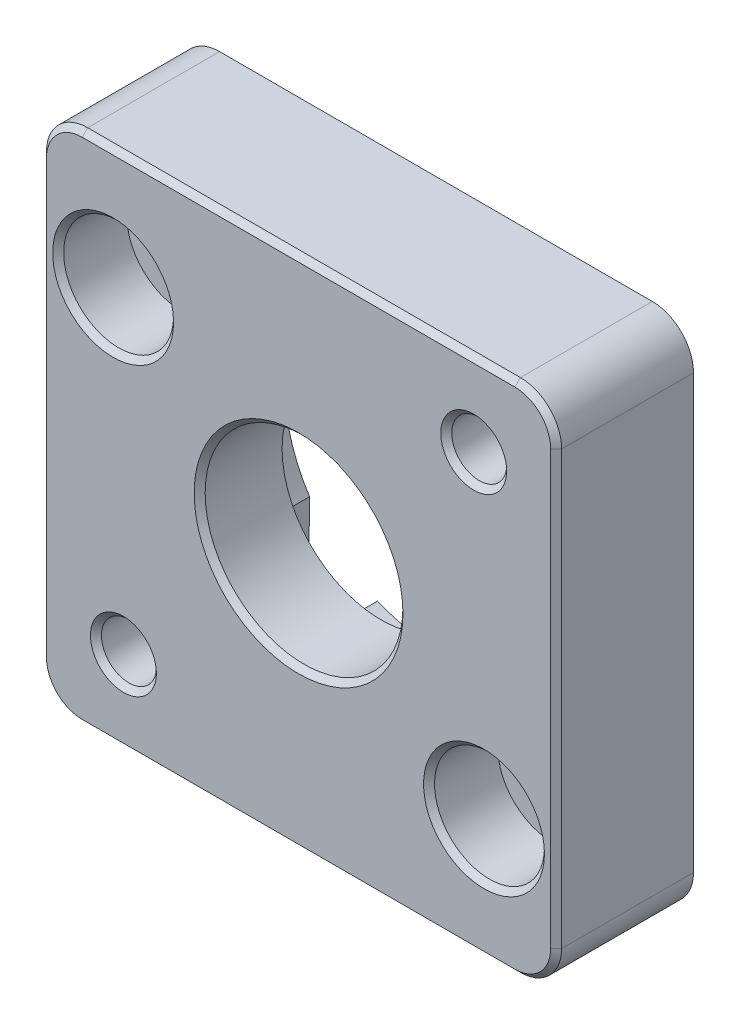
ISO-10303-21;
HEADER;
FILE_DESCRIPTION(('STEP AP214'),'2;1');
FILE_NAME('part.step','',(''),(''),'','','');
FILE_SCHEMA(('AUTOMOTIVE_DESIGN { 1 0 10303 214 1 1 1 1 }'));
ENDSEC;
DATA;
#1=APPLICATION_CONTEXT('core data for automotive mechanical design processes');
#2=APPLICATION_PROTOCOL_DEFINITION('international standard','automotive_design',2000,#1);
#3=PRODUCT_CONTEXT('',#1,'mechanical');
#4=PRODUCT('Part','Part','',(#3));
#5=PRODUCT_RELATED_PRODUCT_CATEGORY('part','',(#4));
#6=PRODUCT_DEFINITION_FORMATION('','',#4);
#7=PRODUCT_DEFINITION_CONTEXT('part definition',#1,'design');
#8=PRODUCT_DEFINITION('design','',#6,#7);
#9=PRODUCT_DEFINITION_SHAPE('','',#8);
#10=(LENGTH_UNIT() NAMED_UNIT(*) SI_UNIT(.MILLI.,.METRE.));
#11=(NAMED_UNIT(*) PLANE_ANGLE_UNIT() SI_UNIT($,.RADIAN.));
#12=(NAMED_UNIT(*) SI_UNIT($,.STERADIAN.) SOLID_ANGLE_UNIT());
#13=UNCERTAINTY_MEASURE_WITH_UNIT(LENGTH_MEASURE(1.E-05),#10,'distance_accuracy_value','');
#14=(GEOMETRIC_REPRESENTATION_CONTEXT(3) GLOBAL_UNCERTAINTY_ASSIGNED_CONTEXT((#13)) GLOBAL_UNIT_ASSIGNED_CONTEXT((#10,
#11,#12)) REPRESENTATION_CONTEXT('',''));
#15=CARTESIAN_POINT('',(0.,0.,0.));
#16=DIRECTION('',(0.,0.,1.));
#17=DIRECTION('',(1.,0.,0.));
#18=AXIS2_PLACEMENT_3D('',#15,#16,#17);
#19=CARTESIAN_POINT('',(-5.25000000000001,8.75000000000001,10.));
#20=DIRECTION('',(0.,0.,-1.));
#21=DIRECTION('',(-1.,0.,0.));
#22=AXIS2_PLACEMENT_3D('',#19,#20,#21);
#23=CYLINDRICAL_SURFACE('',#22,2.25000000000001);
#24=CARTESIAN_POINT('',(-5.25000000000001,8.75000000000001,5.));
#25=DIRECTION('',(0.,0.,-1.));
#26=DIRECTION('',(-1.,0.,0.));
#27=AXIS2_PLACEMENT_3D('',#24,#25,#26);
#28=CIRCLE('',#27,2.25000000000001);
#29=CARTESIAN_POINT('',(-7.50000000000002,8.75000000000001,5.));
#30=VERTEX_POINT('',#29);
#31=EDGE_CURVE('E249',#30,#30,#28,.T.);
#32=ORIENTED_EDGE('',*,*,#31,.F.);
#33=EDGE_LOOP('',(#32));
#34=FACE_BOUND('',#33,.T.);
#35=CARTESIAN_POINT('',(-5.25000000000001,8.75000000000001,0.));
#36=DIRECTION('',(0.,0.,-1.));
#37=DIRECTION('',(-1.,0.,0.));
#38=AXIS2_PLACEMENT_3D('',#35,#36,#37);
#39=CIRCLE('',#38,2.25000000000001);
#40=CARTESIAN_POINT('',(-7.50000000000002,8.75000000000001,0.));
#41=VERTEX_POINT('',#40);
#42=EDGE_CURVE('E243',#41,#41,#39,.T.);
#43=ORIENTED_EDGE('',*,*,#42,.T.);
#44=EDGE_LOOP('',(#43));
#45=FACE_BOUND('',#44,.T.);
#46=ADVANCED_FACE('F17',(#34,#45),#23,.F.);
#47=CARTESIAN_POINT('',(-32.25,28.75,10.));
#48=DIRECTION('',(0.,0.,-1.));
#49=DIRECTION('',(-1.,0.,0.));
#50=AXIS2_PLACEMENT_3D('',#47,#48,#49);
#51=CYLINDRICAL_SURFACE('',#50,2.25000000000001);
#52=CARTESIAN_POINT('',(-32.25,28.75,5.));
#53=DIRECTION('',(0.,0.,-1.));
#54=DIRECTION('',(-1.,0.,0.));
#55=AXIS2_PLACEMENT_3D('',#52,#53,#54);
#56=CIRCLE('',#55,2.25000000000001);
#57=CARTESIAN_POINT('',(-34.5,28.75,5.));
#58=VERTEX_POINT('',#57);
#59=EDGE_CURVE('E246',#58,#58,#56,.T.);
#60=ORIENTED_EDGE('',*,*,#59,.F.);
#61=EDGE_LOOP('',(#60));
#62=FACE_BOUND('',#61,.T.);
#63=CARTESIAN_POINT('',(-32.25,28.75,0.));
#64=DIRECTION('',(0.,0.,-1.));
#65=DIRECTION('',(-1.,0.,0.));
#66=AXIS2_PLACEMENT_3D('',#63,#64,#65);
#67=CIRCLE('',#66,2.25000000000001);
#68=CARTESIAN_POINT('',(-34.5,28.75,0.));
#69=VERTEX_POINT('',#68);
#70=EDGE_CURVE('E240',#69,#69,#67,.T.);
#71=ORIENTED_EDGE('',*,*,#70,.T.);
#72=EDGE_LOOP('',(#71));
#73=FACE_BOUND('',#72,.T.);
#74=ADVANCED_FACE('F804',(#62,#73),#51,.F.);
#75=CARTESIAN_POINT('',(-25.5,8.75,16.8197090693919));
#76=DIRECTION('',(0.,0.,-1.));
#77=DIRECTION('',(-1.,0.,0.));
#78=AXIS2_PLACEMENT_3D('',#75,#76,#77);
#79=CYLINDRICAL_SURFACE('',#78,2.5);
#80=DIRECTION('',(0.,0.,-1.));
#81=VECTOR('',#80,1.);
#82=CARTESIAN_POINT('',(-23.0041547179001,8.60592943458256,7.));
#83=LINE('',#82,#81);
#84=CARTESIAN_POINT('',(-23.0041547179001,8.60592943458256,4.));
#85=VERTEX_POINT('',#84);
#86=CARTESIAN_POINT('',(-23.0041547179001,8.60592943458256,0.));
#87=VERTEX_POINT('',#86);
#88=EDGE_CURVE('E120',#85,#87,#83,.T.);
#89=ORIENTED_EDGE('',*,*,#88,.T.);
#90=CARTESIAN_POINT('',(-25.5,8.75,0.));
#91=DIRECTION('',(0.,0.,-1.));
#92=DIRECTION('',(-1.,0.,0.));
#93=AXIS2_PLACEMENT_3D('',#90,#91,#92);
#94=CIRCLE('',#93,2.5);
#95=CARTESIAN_POINT('',(-27.999780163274,8.7831532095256,0.));
#96=VERTEX_POINT('',#95);
#97=EDGE_CURVE('E238',#87,#96,#94,.T.);
#98=ORIENTED_EDGE('',*,*,#97,.T.);
#99=DIRECTION('',(0.,0.,1.));
#100=VECTOR('',#99,1.);
#101=CARTESIAN_POINT('',(-27.999780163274,8.7831532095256,16.8197090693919));
#102=LINE('',#101,#100);
#103=CARTESIAN_POINT('',(-27.999780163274,8.7831532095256,4.));
#104=VERTEX_POINT('',#103);
#105=EDGE_CURVE('E175',#96,#104,#102,.T.);
#106=ORIENTED_EDGE('',*,*,#105,.T.);
#107=CARTESIAN_POINT('',(-25.5,8.75,4.));
#108=DIRECTION('',(0.,0.,-1.));
#109=DIRECTION('',(-1.,0.,0.));
#110=AXIS2_PLACEMENT_3D('',#107,#108,#109);
#111=CIRCLE('',#110,2.5);
#112=EDGE_CURVE('E252',#104,#85,#111,.F.);
#113=ORIENTED_EDGE('',*,*,#112,.T.);
#114=EDGE_LOOP('',(#89,#98,#106,#113));
#115=FACE_BOUND('',#114,.T.);
#116=ADVANCED_FACE('F263',(#115),#79,.F.);
#117=CARTESIAN_POINT('',(-28.1113217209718,0.372824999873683,16.8197090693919));
#118=DIRECTION('',(-0.999912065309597,0.0132612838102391,0.));
#119=DIRECTION('',(-0.0132612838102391,-0.999912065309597,0.));
#120=AXIS2_PLACEMENT_3D('',#117,#118,#119);
#121=PLANE('',#120);
#122=ORIENTED_EDGE('',*,*,#105,.F.);
#123=DIRECTION('',(0.0132612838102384,0.999912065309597,0.));
#124=VECTOR('',#123,1.);
#125=CARTESIAN_POINT('',(-27.999780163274,8.7831532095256,0.));
#126=LINE('',#125,#124);
#127=CARTESIAN_POINT('',(-27.9476151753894,12.7164376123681,0.));
#128=VERTEX_POINT('',#127);
#129=EDGE_CURVE('E237',#96,#128,#126,.T.);
#130=ORIENTED_EDGE('',*,*,#129,.T.);
#131=DIRECTION('',(0.,0.,-1.));
#132=VECTOR('',#131,1.);
#133=CARTESIAN_POINT('',(-27.9476151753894,12.7164376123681,7.));
#134=LINE('',#133,#132);
#135=CARTESIAN_POINT('',(-27.9476151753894,12.7164376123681,4.));
#136=VERTEX_POINT('',#135);
#137=EDGE_CURVE('E173',#128,#136,#134,.F.);
#138=ORIENTED_EDGE('',*,*,#137,.T.);
#139=DIRECTION('',(-0.0132612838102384,-0.999912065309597,0.));
#140=VECTOR('',#139,1.);
#141=CARTESIAN_POINT('',(-27.9476151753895,12.7164376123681,4.));
#142=LINE('',#141,#140);
#143=EDGE_CURVE('E150',#136,#104,#142,.T.);
#144=ORIENTED_EDGE('',*,*,#143,.T.);
#145=EDGE_LOOP('',(#122,#130,#138,#144));
#146=FACE_BOUND('',#145,.T.);
#147=ADVANCED_FACE('F260',(#146),#121,.F.);
#148=CARTESIAN_POINT('',(-18.75,18.75,7.));
#149=DIRECTION('',(0.,0.,-1.));
#150=DIRECTION('',(-1.,0.,0.));
#151=AXIS2_PLACEMENT_3D('',#148,#149,#150);
#152=CYLINDRICAL_SURFACE('',#151,11.);
#153=ORIENTED_EDGE('',*,*,#137,.F.);
#154=CARTESIAN_POINT('',(-18.75,18.75,0.));
#155=DIRECTION('',(0.,0.,-1.));
#156=DIRECTION('',(-1.,0.,0.));
#157=AXIS2_PLACEMENT_3D('',#154,#155,#156);
#158=CIRCLE('',#157,11.);
#159=CARTESIAN_POINT('',(-14.9813195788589,29.0842657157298,0.));
#160=VERTEX_POINT('',#159);
#161=EDGE_CURVE('E235',#128,#160,#158,.T.);
#162=ORIENTED_EDGE('',*,*,#161,.T.);
#163=DIRECTION('',(0.,0.,-1.));
#164=VECTOR('',#163,1.);
#165=CARTESIAN_POINT('',(-14.9813195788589,29.0842657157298,16.8197090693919));
#166=LINE('',#165,#164);
#167=CARTESIAN_POINT('',(-14.9813195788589,29.0842657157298,4.));
#168=VERTEX_POINT('',#167);
#169=EDGE_CURVE('E171',#160,#168,#166,.F.);
#170=ORIENTED_EDGE('',*,*,#169,.T.);
#171=CARTESIAN_POINT('',(-18.75,18.75,4.));
#172=DIRECTION('',(0.,0.,-1.));
#173=DIRECTION('',(-1.,0.,0.));
#174=AXIS2_PLACEMENT_3D('',#171,#172,#173);
#175=CIRCLE('',#174,11.);
#176=EDGE_CURVE('E147',#168,#136,#175,.F.);
#177=ORIENTED_EDGE('',*,*,#176,.T.);
#178=EDGE_LOOP('',(#153,#162,#170,#177));
#179=FACE_BOUND('',#178,.T.);
#180=ADVANCED_FACE('F781',(#179),#152,.F.);
#181=CARTESIAN_POINT('',(-12.,28.75,16.8197090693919));
#182=DIRECTION('',(0.,0.,-1.));
#183=DIRECTION('',(-1.,0.,0.));
#184=AXIS2_PLACEMENT_3D('',#181,#182,#183);
#185=CYLINDRICAL_SURFACE('',#184,3.);
#186=ORIENTED_EDGE('',*,*,#169,.F.);
#187=CARTESIAN_POINT('',(-12.,28.75,0.));
#188=DIRECTION('',(0.,0.,-1.));
#189=DIRECTION('',(-1.,0.,0.));
#190=AXIS2_PLACEMENT_3D('',#187,#188,#189);
#191=CIRCLE('',#190,3.);
#192=CARTESIAN_POINT('',(-9.00026380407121,28.7102161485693,0.));
#193=VERTEX_POINT('',#192);
#194=EDGE_CURVE('E233',#160,#193,#191,.T.);
#195=ORIENTED_EDGE('',*,*,#194,.T.);
#196=DIRECTION('',(0.,0.,1.));
#197=VECTOR('',#196,1.);
#198=CARTESIAN_POINT('',(-9.00026380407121,28.7102161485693,16.8197090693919));
#199=LINE('',#198,#197);
#200=CARTESIAN_POINT('',(-9.00026380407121,28.7102161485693,4.));
#201=VERTEX_POINT('',#200);
#202=EDGE_CURVE('E168',#193,#201,#199,.T.);
#203=ORIENTED_EDGE('',*,*,#202,.T.);
#204=CARTESIAN_POINT('',(-12.,28.75,4.));
#205=DIRECTION('',(0.,0.,-1.));
#206=DIRECTION('',(-1.,0.,0.));
#207=AXIS2_PLACEMENT_3D('',#204,#205,#206);
#208=CIRCLE('',#207,3.);
#209=EDGE_CURVE('E145',#201,#168,#208,.F.);
#210=ORIENTED_EDGE('',*,*,#209,.T.);
#211=EDGE_LOOP('',(#186,#195,#203,#210));
#212=FACE_BOUND('',#211,.T.);
#213=ADVANCED_FACE('F773',(#212),#185,.F.);
#214=CARTESIAN_POINT('',(-9.37938184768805,0.124393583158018,16.8197090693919));
#215=DIRECTION('',(0.999912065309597,-0.013261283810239,0.));
#216=DIRECTION('',(0.013261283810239,0.999912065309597,0.));
#217=AXIS2_PLACEMENT_3D('',#214,#215,#216);
#218=PLANE('',#217);
#219=ORIENTED_EDGE('',*,*,#202,.F.);
#220=DIRECTION('',(-0.013261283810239,-0.999912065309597,0.));
#221=VECTOR('',#220,1.);
#222=CARTESIAN_POINT('',(-9.00026380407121,28.7102161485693,0.));
#223=LINE('',#222,#221);
#224=CARTESIAN_POINT('',(-9.06323470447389,23.9621567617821,0.));
#225=VERTEX_POINT('',#224);
#226=EDGE_CURVE('E133',#193,#225,#223,.T.);
#227=ORIENTED_EDGE('',*,*,#226,.T.);
#228=DIRECTION('',(0.,0.,-1.));
#229=VECTOR('',#228,1.);
#230=CARTESIAN_POINT('',(-9.06323470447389,23.9621567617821,7.));
#231=LINE('',#230,#229);
#232=CARTESIAN_POINT('',(-9.06323470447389,23.9621567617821,4.));
#233=VERTEX_POINT('',#232);
#234=EDGE_CURVE('E126',#225,#233,#231,.F.);
#235=ORIENTED_EDGE('',*,*,#234,.T.);
#236=DIRECTION('',(0.0132612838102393,0.999912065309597,0.));
#237=VECTOR('',#236,1.);
#238=CARTESIAN_POINT('',(-9.06323470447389,23.9621567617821,4.));
#239=LINE('',#238,#237);
#240=EDGE_CURVE('E130',#233,#201,#239,.T.);
#241=ORIENTED_EDGE('',*,*,#240,.T.);
#242=EDGE_LOOP('',(#219,#227,#235,#241));
#243=FACE_BOUND('',#242,.T.);
#244=ADVANCED_FACE('F128',(#243),#218,.F.);
#245=CARTESIAN_POINT('',(-18.75,18.75,7.));
#246=DIRECTION('',(0.,0.,-1.));
#247=DIRECTION('',(-1.,0.,0.));
#248=AXIS2_PLACEMENT_3D('',#245,#246,#247);
#249=CYLINDRICAL_SURFACE('',#248,11.);
#250=ORIENTED_EDGE('',*,*,#234,.F.);
#251=CARTESIAN_POINT('',(-18.75,18.75,0.));
#252=DIRECTION('',(0.,0.,-1.));
#253=DIRECTION('',(-1.,0.,0.));
#254=AXIS2_PLACEMENT_3D('',#251,#252,#253);
#255=CIRCLE('',#254,11.);
#256=EDGE_CURVE('E159',#225,#87,#255,.T.);
#257=ORIENTED_EDGE('',*,*,#256,.T.);
#258=ORIENTED_EDGE('',*,*,#88,.F.);
#259=CARTESIAN_POINT('',(-18.75,18.75,4.));
#260=DIRECTION('',(0.,0.,-1.));
#261=DIRECTION('',(-1.,0.,0.));
#262=AXIS2_PLACEMENT_3D('',#259,#260,#261);
#263=CIRCLE('',#262,11.);
#264=EDGE_CURVE('E20',#85,#233,#263,.F.);
#265=ORIENTED_EDGE('',*,*,#264,.T.);
#266=EDGE_LOOP('',(#250,#257,#258,#265));
#267=FACE_BOUND('',#266,.T.);
#268=ADVANCED_FACE('F137',(#267),#249,.F.);
#269=CARTESIAN_POINT('',(0.,0.,4.));
#270=DIRECTION('',(0.,0.,1.));
#271=DIRECTION('',(1.,0.,0.));
#272=AXIS2_PLACEMENT_3D('',#269,#270,#271);
#273=PLANE('',#272);
#274=ORIENTED_EDGE('',*,*,#143,.F.);
#275=ORIENTED_EDGE('',*,*,#176,.F.);
#276=ORIENTED_EDGE('',*,*,#209,.F.);
#277=ORIENTED_EDGE('',*,*,#240,.F.);
#278=ORIENTED_EDGE('',*,*,#264,.F.);
#279=ORIENTED_EDGE('',*,*,#112,.F.);
#280=EDGE_LOOP('',(#274,#275,#276,#277,#278,#279));
#281=FACE_BOUND('',#280,.T.);
#282=CARTESIAN_POINT('',(-18.7499999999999,18.75,4.));
#283=DIRECTION('',(0.,0.,1.));
#284=DIRECTION('',(1.,0.,0.));
#285=AXIS2_PLACEMENT_3D('',#282,#283,#284);
#286=CIRCLE('',#285,7.2);
#287=CARTESIAN_POINT('',(-11.5499999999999,18.75,4.));
#288=VERTEX_POINT('',#287);
#289=EDGE_CURVE('E217',#288,#288,#286,.T.);
#290=ORIENTED_EDGE('',*,*,#289,.T.);
#291=EDGE_LOOP('',(#290));
#292=FACE_BOUND('',#291,.T.);
#293=ADVANCED_FACE('F141',(#281,#292),#273,.F.);
#294=CARTESIAN_POINT('',(-5.25000000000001,8.75000000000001,5.));
#295=DIRECTION('',(0.,0.,1.));
#296=DIRECTION('',(1.,0.,0.));
#297=AXIS2_PLACEMENT_3D('',#294,#295,#296);
#298=PLANE('',#297);
#299=ORIENTED_EDGE('',*,*,#31,.T.);
#300=EDGE_LOOP('',(#299));
#301=FACE_BOUND('',#300,.T.);
#302=CARTESIAN_POINT('',(-5.25000000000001,8.75000000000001,5.));
#303=DIRECTION('',(0.,0.,1.));
#304=DIRECTION('',(1.,0.,0.));
#305=AXIS2_PLACEMENT_3D('',#302,#303,#304);
#306=CIRCLE('',#305,4.);
#307=CARTESIAN_POINT('',(-1.25000000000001,8.75000000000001,5.));
#308=VERTEX_POINT('',#307);
#309=EDGE_CURVE('E214',#308,#308,#306,.T.);
#310=ORIENTED_EDGE('',*,*,#309,.T.);
#311=EDGE_LOOP('',(#310));
#312=FACE_BOUND('',#311,.T.);
#313=ADVANCED_FACE('F742',(#301,#312),#298,.T.);
#314=CARTESIAN_POINT('',(-32.25,28.75,5.));
#315=DIRECTION('',(0.,0.,1.));
#316=DIRECTION('',(1.,0.,0.));
#317=AXIS2_PLACEMENT_3D('',#314,#315,#316);
#318=PLANE('',#317);
#319=ORIENTED_EDGE('',*,*,#59,.T.);
#320=EDGE_LOOP('',(#319));
#321=FACE_BOUND('',#320,.T.);
#322=CARTESIAN_POINT('',(-32.25,28.75,5.));
#323=DIRECTION('',(0.,0.,1.));
#324=DIRECTION('',(1.,0.,0.));
#325=AXIS2_PLACEMENT_3D('',#322,#323,#324);
#326=CIRCLE('',#325,4.);
#327=CARTESIAN_POINT('',(-28.25,28.75,5.));
#328=VERTEX_POINT('',#327);
#329=EDGE_CURVE('E211',#328,#328,#326,.T.);
#330=ORIENTED_EDGE('',*,*,#329,.T.);
#331=EDGE_LOOP('',(#330));
#332=FACE_BOUND('',#331,.T.);
#333=ADVANCED_FACE('F734',(#321,#332),#318,.T.);
#334=CARTESIAN_POINT('',(0.,0.,0.));
#335=DIRECTION('',(0.,0.,1.));
#336=DIRECTION('',(1.,0.,0.));
#337=AXIS2_PLACEMENT_3D('',#334,#335,#336);
#338=PLANE('',#337);
#339=CARTESIAN_POINT('',(-34.5,3.,0.));
#340=DIRECTION('',(0.,0.,-1.));
#341=DIRECTION('',(-1.,0.,0.));
#342=AXIS2_PLACEMENT_3D('',#339,#340,#341);
#343=CIRCLE('',#342,3.);
#344=CARTESIAN_POINT('',(-37.5,3.,0.));
#345=VERTEX_POINT('',#344);
#346=CARTESIAN_POINT('',(-34.5,0.,0.));
#347=VERTEX_POINT('',#346);
#348=EDGE_CURVE('E163',#345,#347,#343,.F.);
#349=ORIENTED_EDGE('',*,*,#348,.F.);
#350=DIRECTION('',(0.,1.,0.));
#351=VECTOR('',#350,1.);
#352=CARTESIAN_POINT('',(-37.5,37.5,0.));
#353=LINE('',#352,#351);
#354=CARTESIAN_POINT('',(-37.5,34.5,0.));
#355=VERTEX_POINT('',#354);
#356=EDGE_CURVE('E164',#345,#355,#353,.T.);
#357=ORIENTED_EDGE('',*,*,#356,.T.);
#358=CARTESIAN_POINT('',(-34.5,34.5,0.));
#359=DIRECTION('',(0.,0.,-1.));
#360=DIRECTION('',(-1.,0.,0.));
#361=AXIS2_PLACEMENT_3D('',#358,#359,#360);
#362=CIRCLE('',#361,3.);
#363=CARTESIAN_POINT('',(-34.5,37.5,0.));
#364=VERTEX_POINT('',#363);
#365=EDGE_CURVE('E167',#364,#355,#362,.F.);
#366=ORIENTED_EDGE('',*,*,#365,.F.);
#367=DIRECTION('',(1.,0.,0.));
#368=VECTOR('',#367,1.);
#369=CARTESIAN_POINT('',(-37.5,37.5,0.));
#370=LINE('',#369,#368);
#371=CARTESIAN_POINT('',(-3.,37.5,0.));
#372=VERTEX_POINT('',#371);
#373=EDGE_CURVE('E156',#364,#372,#370,.T.);
#374=ORIENTED_EDGE('',*,*,#373,.T.);
#375=CARTESIAN_POINT('',(-3.,34.5,0.));
#376=DIRECTION('',(0.,0.,-1.));
#377=DIRECTION('',(-1.,0.,0.));
#378=AXIS2_PLACEMENT_3D('',#375,#376,#377);
#379=CIRCLE('',#378,3.);
#380=CARTESIAN_POINT('',(0.,34.5,0.));
#381=VERTEX_POINT('',#380);
#382=EDGE_CURVE('E220',#381,#372,#379,.F.);
#383=ORIENTED_EDGE('',*,*,#382,.F.);
#384=DIRECTION('',(0.,1.,0.));
#385=VECTOR('',#384,1.);
#386=CARTESIAN_POINT('',(0.,37.5,0.));
#387=LINE('',#386,#385);
#388=CARTESIAN_POINT('',(0.,3.,0.));
#389=VERTEX_POINT('',#388);
#390=EDGE_CURVE('E152',#381,#389,#387,.F.);
#391=ORIENTED_EDGE('',*,*,#390,.T.);
#392=CARTESIAN_POINT('',(-3.,3.,0.));
#393=DIRECTION('',(0.,0.,-1.));
#394=DIRECTION('',(-1.,0.,0.));
#395=AXIS2_PLACEMENT_3D('',#392,#393,#394);
#396=CIRCLE('',#395,3.);
#397=CARTESIAN_POINT('',(-3.,0.,0.));
#398=VERTEX_POINT('',#397);
#399=EDGE_CURVE('E155',#398,#389,#396,.F.);
#400=ORIENTED_EDGE('',*,*,#399,.F.);
#401=DIRECTION('',(1.,0.,0.));
#402=VECTOR('',#401,1.);
#403=CARTESIAN_POINT('',(-37.5,0.,0.));
#404=LINE('',#403,#402);
#405=EDGE_CURVE('E160',#398,#347,#404,.F.);
#406=ORIENTED_EDGE('',*,*,#405,.T.);
#407=EDGE_LOOP('',(#349,#357,#366,#374,#383,#391,#400,#406));
#408=FACE_BOUND('',#407,.T.);
#409=ORIENTED_EDGE('',*,*,#226,.F.);
#410=ORIENTED_EDGE('',*,*,#194,.F.);
#411=ORIENTED_EDGE('',*,*,#161,.F.);
#412=ORIENTED_EDGE('',*,*,#129,.F.);
#413=ORIENTED_EDGE('',*,*,#97,.F.);
#414=ORIENTED_EDGE('',*,*,#256,.F.);
#415=EDGE_LOOP('',(#409,#410,#411,#412,#413,#414));
#416=FACE_BOUND('',#415,.T.);
#417=ORIENTED_EDGE('',*,*,#70,.F.);
#418=EDGE_LOOP('',(#417));
#419=FACE_BOUND('',#418,.T.);
#420=ORIENTED_EDGE('',*,*,#42,.F.);
#421=EDGE_LOOP('',(#420));
#422=FACE_BOUND('',#421,.T.);
#423=CARTESIAN_POINT('',(-6.,31.5,0.));
#424=DIRECTION('',(0.,0.,1.));
#425=DIRECTION('',(1.,0.,0.));
#426=AXIS2_PLACEMENT_3D('',#423,#424,#425);
#427=CIRCLE('',#426,2.);
#428=CARTESIAN_POINT('',(-4.,31.5,0.));
#429=VERTEX_POINT('',#428);
#430=EDGE_CURVE('E208',#429,#429,#427,.T.);
#431=ORIENTED_EDGE('',*,*,#430,.T.);
#432=EDGE_LOOP('',(#431));
#433=FACE_BOUND('',#432,.T.);
#434=CARTESIAN_POINT('',(-31.5,6.,0.));
#435=DIRECTION('',(0.,0.,1.));
#436=DIRECTION('',(1.,0.,0.));
#437=AXIS2_PLACEMENT_3D('',#434,#435,#436);
#438=CIRCLE('',#437,2.);
#439=CARTESIAN_POINT('',(-29.5,6.,0.));
#440=VERTEX_POINT('',#439);
#441=EDGE_CURVE('E204',#440,#440,#438,.T.);
#442=ORIENTED_EDGE('',*,*,#441,.T.);
#443=EDGE_LOOP('',(#442));
#444=FACE_BOUND('',#443,.T.);
#445=ADVANCED_FACE('F266',(#408,#416,#419,#422,#433,#444),#338,.F.);
#446=CARTESIAN_POINT('',(-37.5,37.5,10.));
#447=DIRECTION('',(0.,-1.,0.));
#448=DIRECTION('',(0.,0.,-1.));
#449=AXIS2_PLACEMENT_3D('',#446,#447,#448);
#450=PLANE('',#449);
#451=DIRECTION('',(1.,0.,0.));
#452=VECTOR('',#451,1.);
#453=CARTESIAN_POINT('',(0.,37.5,9.6));
#454=LINE('',#453,#452);
#455=CARTESIAN_POINT('',(-3.,37.4999999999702,9.60000000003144));
#456=VERTEX_POINT('',#455);
#457=CARTESIAN_POINT('',(-34.5,37.5000000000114,9.59999999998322));
#458=VERTEX_POINT('',#457);
#459=EDGE_CURVE('E207',#456,#458,#454,.F.);
#460=ORIENTED_EDGE('',*,*,#459,.F.);
#461=DIRECTION('',(0.,0.,-1.));
#462=VECTOR('',#461,1.);
#463=CARTESIAN_POINT('',(-3.,37.5,10.));
#464=LINE('',#463,#462);
#465=EDGE_CURVE('E327',#372,#456,#464,.F.);
#466=ORIENTED_EDGE('',*,*,#465,.F.);
#467=ORIENTED_EDGE('',*,*,#373,.F.);
#468=DIRECTION('',(0.,0.,-1.));
#469=VECTOR('',#468,1.);
#470=CARTESIAN_POINT('',(-34.5,37.5,10.));
#471=LINE('',#470,#469);
#472=EDGE_CURVE('E158',#458,#364,#471,.T.);
#473=ORIENTED_EDGE('',*,*,#472,.F.);
#474=EDGE_LOOP('',(#460,#466,#467,#473));
#475=FACE_BOUND('',#474,.T.);
#476=ADVANCED_FACE('F456',(#475),#450,.F.);
#477=CARTESIAN_POINT('',(-34.5,34.5,10.));
#478=DIRECTION('',(0.,0.,-1.));
#479=DIRECTION('',(-1.,0.,0.));
#480=AXIS2_PLACEMENT_3D('',#477,#478,#479);
#481=CYLINDRICAL_SURFACE('',#480,3.);
#482=ORIENTED_EDGE('',*,*,#472,.T.);
#483=ORIENTED_EDGE('',*,*,#365,.T.);
#484=DIRECTION('',(0.,0.,-1.));
#485=VECTOR('',#484,1.);
#486=CARTESIAN_POINT('',(-37.5,34.5,10.));
#487=LINE('',#486,#485);
#488=CARTESIAN_POINT('',(-37.5000000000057,34.5,9.5999999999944));
#489=VERTEX_POINT('',#488);
#490=EDGE_CURVE('E166',#355,#489,#487,.F.);
#491=ORIENTED_EDGE('',*,*,#490,.T.);
#492=CARTESIAN_POINT('',(-34.5,34.5,9.59999999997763));
#493=DIRECTION('',(0.,0.,-1.));
#494=DIRECTION('',(-1.,0.,0.));
#495=AXIS2_PLACEMENT_3D('',#492,#493,#494);
#496=CIRCLE('',#495,3.00000000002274);
#497=EDGE_CURVE('E278',#458,#489,#496,.F.);
#498=ORIENTED_EDGE('',*,*,#497,.F.);
#499=EDGE_LOOP('',(#482,#483,#491,#498));
#500=FACE_BOUND('',#499,.T.);
#501=ADVANCED_FACE('F458',(#500),#481,.T.);
#502=CARTESIAN_POINT('',(-37.5,37.5,10.));
#503=DIRECTION('',(1.,0.,0.));
#504=DIRECTION('',(0.,0.,-1.));
#505=AXIS2_PLACEMENT_3D('',#502,#503,#504);
#506=PLANE('',#505);
#507=DIRECTION('',(0.,1.,0.));
#508=VECTOR('',#507,1.);
#509=CARTESIAN_POINT('',(-37.5,0.,9.6));
#510=LINE('',#509,#508);
#511=CARTESIAN_POINT('',(-37.5000000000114,3.,9.59999999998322));
#512=VERTEX_POINT('',#511);
#513=EDGE_CURVE('E289',#489,#512,#510,.F.);
#514=ORIENTED_EDGE('',*,*,#513,.F.);
#515=ORIENTED_EDGE('',*,*,#490,.F.);
#516=ORIENTED_EDGE('',*,*,#356,.F.);
#517=DIRECTION('',(0.,0.,-1.));
#518=VECTOR('',#517,1.);
#519=CARTESIAN_POINT('',(-37.5,3.,10.));
#520=LINE('',#519,#518);
#521=EDGE_CURVE('E229',#512,#345,#520,.T.);
#522=ORIENTED_EDGE('',*,*,#521,.F.);
#523=EDGE_LOOP('',(#514,#515,#516,#522));
#524=FACE_BOUND('',#523,.T.);
#525=ADVANCED_FACE('F482',(#524),#506,.F.);
#526=CARTESIAN_POINT('',(-34.5,3.,10.));
#527=DIRECTION('',(0.,0.,-1.));
#528=DIRECTION('',(-1.,0.,0.));
#529=AXIS2_PLACEMENT_3D('',#526,#527,#528);
#530=CYLINDRICAL_SURFACE('',#529,3.);
#531=ORIENTED_EDGE('',*,*,#521,.T.);
#532=ORIENTED_EDGE('',*,*,#348,.T.);
#533=DIRECTION('',(0.,0.,1.));
#534=VECTOR('',#533,1.);
#535=CARTESIAN_POINT('',(-34.5,0.,10.));
#536=LINE('',#535,#534);
#537=CARTESIAN_POINT('',(-34.5,-5.6853664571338E-12,9.5999999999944));
#538=VERTEX_POINT('',#537);
#539=EDGE_CURVE('E162',#347,#538,#536,.T.);
#540=ORIENTED_EDGE('',*,*,#539,.T.);
#541=CARTESIAN_POINT('',(-34.5,3.,9.59999999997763));
#542=DIRECTION('',(0.,0.,-1.));
#543=DIRECTION('',(-1.,0.,0.));
#544=AXIS2_PLACEMENT_3D('',#541,#542,#543);
#545=CIRCLE('',#544,3.00000000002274);
#546=EDGE_CURVE('E299',#512,#538,#545,.F.);
#547=ORIENTED_EDGE('',*,*,#546,.F.);
#548=EDGE_LOOP('',(#531,#532,#540,#547));
#549=FACE_BOUND('',#548,.T.);
#550=ADVANCED_FACE('F484',(#549),#530,.T.);
#551=CARTESIAN_POINT('',(-37.5,0.,10.));
#552=DIRECTION('',(0.,1.,0.));
#553=DIRECTION('',(0.,0.,1.));
#554=AXIS2_PLACEMENT_3D('',#551,#552,#553);
#555=PLANE('',#554);
#556=DIRECTION('',(1.,0.,0.));
#557=VECTOR('',#556,1.);
#558=CARTESIAN_POINT('',(0.,0.,9.6));
#559=LINE('',#558,#557);
#560=CARTESIAN_POINT('',(-3.,2.12607573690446E-11,9.60000000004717));
#561=VERTEX_POINT('',#560);
#562=EDGE_CURVE('E309',#538,#561,#559,.T.);
#563=ORIENTED_EDGE('',*,*,#562,.F.);
#564=ORIENTED_EDGE('',*,*,#539,.F.);
#565=ORIENTED_EDGE('',*,*,#405,.F.);
#566=DIRECTION('',(0.,0.,-1.));
#567=VECTOR('',#566,1.);
#568=CARTESIAN_POINT('',(-3.,0.,10.));
#569=LINE('',#568,#567);
#570=EDGE_CURVE('E226',#561,#398,#569,.T.);
#571=ORIENTED_EDGE('',*,*,#570,.F.);
#572=EDGE_LOOP('',(#563,#564,#565,#571));
#573=FACE_BOUND('',#572,.T.);
#574=ADVANCED_FACE('F476',(#573),#555,.F.);
#575=CARTESIAN_POINT('',(-3.,3.,10.));
#576=DIRECTION('',(0.,0.,-1.));
#577=DIRECTION('',(-1.,0.,0.));
#578=AXIS2_PLACEMENT_3D('',#575,#576,#577);
#579=CYLINDRICAL_SURFACE('',#578,3.);
#580=ORIENTED_EDGE('',*,*,#570,.T.);
#581=ORIENTED_EDGE('',*,*,#399,.T.);
#582=DIRECTION('',(0.,0.,1.));
#583=VECTOR('',#582,1.);
#584=CARTESIAN_POINT('',(0.,3.,10.));
#585=LINE('',#584,#583);
#586=CARTESIAN_POINT('',(-7.04858805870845E-12,3.,9.60000000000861));
#587=VERTEX_POINT('',#586);
#588=EDGE_CURVE('E154',#389,#587,#585,.T.);
#589=ORIENTED_EDGE('',*,*,#588,.T.);
#590=CARTESIAN_POINT('',(-3.,3.,9.60000000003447));
#591=DIRECTION('',(0.,0.,-1.));
#592=DIRECTION('',(-1.,0.,0.));
#593=AXIS2_PLACEMENT_3D('',#590,#591,#592);
#594=CIRCLE('',#593,2.99999999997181);
#595=EDGE_CURVE('E319',#561,#587,#594,.F.);
#596=ORIENTED_EDGE('',*,*,#595,.F.);
#597=EDGE_LOOP('',(#580,#581,#589,#596));
#598=FACE_BOUND('',#597,.T.);
#599=ADVANCED_FACE('F478',(#598),#579,.T.);
#600=CARTESIAN_POINT('',(0.,37.5,10.));
#601=DIRECTION('',(-1.,0.,0.));
#602=DIRECTION('',(0.,0.,1.));
#603=AXIS2_PLACEMENT_3D('',#600,#601,#602);
#604=PLANE('',#603);
#605=DIRECTION('',(0.,1.,0.));
#606=VECTOR('',#605,1.);
#607=CARTESIAN_POINT('',(0.,0.,9.6));
#608=LINE('',#607,#606);
#609=CARTESIAN_POINT('',(-2.12614078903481E-11,34.5,9.60000000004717));
#610=VERTEX_POINT('',#609);
#611=EDGE_CURVE('E330',#587,#610,#608,.T.);
#612=ORIENTED_EDGE('',*,*,#611,.F.);
#613=ORIENTED_EDGE('',*,*,#588,.F.);
#614=ORIENTED_EDGE('',*,*,#390,.F.);
#615=DIRECTION('',(0.,0.,-1.));
#616=VECTOR('',#615,1.);
#617=CARTESIAN_POINT('',(0.,34.5,10.));
#618=LINE('',#617,#616);
#619=EDGE_CURVE('E223',#610,#381,#618,.T.);
#620=ORIENTED_EDGE('',*,*,#619,.F.);
#621=EDGE_LOOP('',(#612,#613,#614,#620));
#622=FACE_BOUND('',#621,.T.);
#623=ADVANCED_FACE('F430',(#622),#604,.F.);
#624=CARTESIAN_POINT('',(-3.,34.5,10.));
#625=DIRECTION('',(0.,0.,-1.));
#626=DIRECTION('',(-1.,0.,0.));
#627=AXIS2_PLACEMENT_3D('',#624,#625,#626);
#628=CYLINDRICAL_SURFACE('',#627,3.);
#629=ORIENTED_EDGE('',*,*,#619,.T.);
#630=ORIENTED_EDGE('',*,*,#382,.T.);
#631=ORIENTED_EDGE('',*,*,#465,.T.);
#632=CARTESIAN_POINT('',(-3.,34.5,9.60000000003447));
#633=DIRECTION('',(0.,0.,-1.));
#634=DIRECTION('',(-1.,0.,0.));
#635=AXIS2_PLACEMENT_3D('',#632,#633,#634);
#636=CIRCLE('',#635,2.9999999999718);
#637=EDGE_CURVE('E342',#610,#456,#636,.F.);
#638=ORIENTED_EDGE('',*,*,#637,.F.);
#639=EDGE_LOOP('',(#629,#630,#631,#638));
#640=FACE_BOUND('',#639,.T.);
#641=ADVANCED_FACE('F434',(#640),#628,.T.);
#642=CARTESIAN_POINT('',(-18.7499999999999,18.75,0.));
#643=DIRECTION('',(0.,0.,1.));
#644=DIRECTION('',(1.,0.,0.));
#645=AXIS2_PLACEMENT_3D('',#642,#643,#644);
#646=CYLINDRICAL_SURFACE('',#645,7.2);
#647=ORIENTED_EDGE('',*,*,#289,.F.);
#648=EDGE_LOOP('',(#647));
#649=FACE_BOUND('',#648,.T.);
#650=CARTESIAN_POINT('',(-18.7499999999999,18.75,9.60000000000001));
#651=DIRECTION('',(0.,0.,1.));
#652=DIRECTION('',(1.,0.,0.));
#653=AXIS2_PLACEMENT_3D('',#650,#651,#652);
#654=CIRCLE('',#653,7.2);
#655=CARTESIAN_POINT('',(-11.5499999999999,18.75,9.60000000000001));
#656=VERTEX_POINT('',#655);
#657=EDGE_CURVE('E381',#656,#656,#654,.T.);
#658=ORIENTED_EDGE('',*,*,#657,.T.);
#659=EDGE_LOOP('',(#658));
#660=FACE_BOUND('',#659,.T.);
#661=ADVANCED_FACE('F552',(#649,#660),#646,.F.);
#662=CARTESIAN_POINT('',(-5.25000000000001,8.75000000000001,5.));
#663=DIRECTION('',(0.,0.,1.));
#664=DIRECTION('',(1.,0.,0.));
#665=AXIS2_PLACEMENT_3D('',#662,#663,#664);
#666=CYLINDRICAL_SURFACE('',#665,4.);
#667=ORIENTED_EDGE('',*,*,#309,.F.);
#668=EDGE_LOOP('',(#667));
#669=FACE_BOUND('',#668,.T.);
#670=CARTESIAN_POINT('',(-5.25000000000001,8.75000000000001,9.60000000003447));
#671=DIRECTION('',(0.,0.,1.));
#672=DIRECTION('',(1.,0.,0.));
#673=AXIS2_PLACEMENT_3D('',#670,#671,#672);
#674=CIRCLE('',#673,3.99999999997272);
#675=CARTESIAN_POINT('',(-1.25000000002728,8.75000000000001,9.60000000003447));
#676=VERTEX_POINT('',#675);
#677=EDGE_CURVE('E386',#676,#676,#674,.T.);
#678=ORIENTED_EDGE('',*,*,#677,.T.);
#679=EDGE_LOOP('',(#678));
#680=FACE_BOUND('',#679,.T.);
#681=ADVANCED_FACE('F548',(#669,#680),#666,.F.);
#682=CARTESIAN_POINT('',(-32.25,28.75,5.));
#683=DIRECTION('',(0.,0.,1.));
#684=DIRECTION('',(1.,0.,0.));
#685=AXIS2_PLACEMENT_3D('',#682,#683,#684);
#686=CYLINDRICAL_SURFACE('',#685,4.);
#687=ORIENTED_EDGE('',*,*,#329,.F.);
#688=EDGE_LOOP('',(#687));
#689=FACE_BOUND('',#688,.T.);
#690=CARTESIAN_POINT('',(-32.25,28.75,9.60000000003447));
#691=DIRECTION('',(0.,0.,1.));
#692=DIRECTION('',(1.,0.,0.));
#693=AXIS2_PLACEMENT_3D('',#690,#691,#692);
#694=CIRCLE('',#693,3.9999999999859);
#695=CARTESIAN_POINT('',(-28.2500000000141,28.75,9.60000000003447));
#696=VERTEX_POINT('',#695);
#697=EDGE_CURVE('E391',#696,#696,#694,.T.);
#698=ORIENTED_EDGE('',*,*,#697,.T.);
#699=EDGE_LOOP('',(#698));
#700=FACE_BOUND('',#699,.T.);
#701=ADVANCED_FACE('F544',(#689,#700),#686,.F.);
#702=CARTESIAN_POINT('',(-6.,31.5,0.));
#703=DIRECTION('',(0.,0.,1.));
#704=DIRECTION('',(1.,0.,0.));
#705=AXIS2_PLACEMENT_3D('',#702,#703,#704);
#706=CYLINDRICAL_SURFACE('',#705,2.);
#707=ORIENTED_EDGE('',*,*,#430,.F.);
#708=EDGE_LOOP('',(#707));
#709=FACE_BOUND('',#708,.T.);
#710=CARTESIAN_POINT('',(-6.,31.5,9.59999999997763));
#711=DIRECTION('',(0.,0.,1.));
#712=DIRECTION('',(1.,0.,0.));
#713=AXIS2_PLACEMENT_3D('',#710,#711,#712);
#714=CIRCLE('',#713,1.9999999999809);
#715=CARTESIAN_POINT('',(-4.0000000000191,31.5,9.59999999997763));
#716=VERTEX_POINT('',#715);
#717=EDGE_CURVE('E396',#716,#716,#714,.T.);
#718=ORIENTED_EDGE('',*,*,#717,.T.);
#719=EDGE_LOOP('',(#718));
#720=FACE_BOUND('',#719,.T.);
#721=ADVANCED_FACE('F540',(#709,#720),#706,.F.);
#722=CARTESIAN_POINT('',(-31.5,6.,0.));
#723=DIRECTION('',(0.,0.,1.));
#724=DIRECTION('',(1.,0.,0.));
#725=AXIS2_PLACEMENT_3D('',#722,#723,#724);
#726=CYLINDRICAL_SURFACE('',#725,2.);
#727=ORIENTED_EDGE('',*,*,#441,.F.);
#728=EDGE_LOOP('',(#727));
#729=FACE_BOUND('',#728,.T.);
#730=CARTESIAN_POINT('',(-31.5,6.,9.59999999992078));
#731=DIRECTION('',(0.,0.,1.));
#732=DIRECTION('',(1.,0.,0.));
#733=AXIS2_PLACEMENT_3D('',#730,#731,#732);
#734=CIRCLE('',#733,2.00000000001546);
#735=CARTESIAN_POINT('',(-29.4999999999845,6.,9.59999999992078));
#736=VERTEX_POINT('',#735);
#737=EDGE_CURVE('E401',#736,#736,#734,.T.);
#738=ORIENTED_EDGE('',*,*,#737,.T.);
#739=EDGE_LOOP('',(#738));
#740=FACE_BOUND('',#739,.T.);
#741=ADVANCED_FACE('F537',(#729,#740),#726,.F.);
#742=CARTESIAN_POINT('',(0.,37.1,10.));
#743=DIRECTION('',(0.,0.707106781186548,0.707106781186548));
#744=DIRECTION('',(0.,-0.707106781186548,0.707106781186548));
#745=AXIS2_PLACEMENT_3D('',#742,#743,#744);
#746=PLANE('',#745);
#747=DIRECTION('',(0.,-0.707106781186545,0.70710678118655));
#748=VECTOR('',#747,1.);
#749=CARTESIAN_POINT('',(-34.5000000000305,499000.,-498952.900000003));
#750=LINE('',#749,#748);
#751=CARTESIAN_POINT('',(-34.5,37.0999999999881,10.0000000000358));
#752=VERTEX_POINT('',#751);
#753=EDGE_CURVE('E282',#752,#458,#750,.F.);
#754=ORIENTED_EDGE('',*,*,#753,.F.);
#755=DIRECTION('',(1.,0.,0.));
#756=VECTOR('',#755,1.);
#757=CARTESIAN_POINT('',(0.,37.1,10.));
#758=LINE('',#757,#756);
#759=CARTESIAN_POINT('',(-3.,37.0999999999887,10.0000000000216));
#760=VERTEX_POINT('',#759);
#761=EDGE_CURVE('E203',#760,#752,#758,.F.);
#762=ORIENTED_EDGE('',*,*,#761,.F.);
#763=DIRECTION('',(0.,-0.707106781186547,0.707106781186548));
#764=VECTOR('',#763,1.);
#765=CARTESIAN_POINT('',(-3.00000000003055,499031.5,-498984.4));
#766=LINE('',#765,#764);
#767=EDGE_CURVE('E345',#456,#760,#766,.T.);
#768=ORIENTED_EDGE('',*,*,#767,.F.);
#769=ORIENTED_EDGE('',*,*,#459,.T.);
#770=EDGE_LOOP('',(#754,#762,#768,#769));
#771=FACE_BOUND('',#770,.T.);
#772=ADVANCED_FACE('F440',(#771),#746,.T.);
#773=CARTESIAN_POINT('',(-34.5,34.5,9.59999999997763));
#774=DIRECTION('',(0.,0.,-1.));
#775=DIRECTION('',(-1.,0.,0.));
#776=AXIS2_PLACEMENT_3D('',#773,#774,#775);
#777=CONICAL_SURFACE('',#776,3.00000000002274,0.785398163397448);
#778=DIRECTION('',(0.707106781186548,0.,0.707106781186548));
#779=VECTOR('',#778,1.);
#780=CARTESIAN_POINT('',(-37.1,34.5,10.));
#781=LINE('',#780,#779);
#782=CARTESIAN_POINT('',(-37.0999999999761,34.5,10.0000000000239));
#783=VERTEX_POINT('',#782);
#784=EDGE_CURVE('E281',#783,#489,#781,.F.);
#785=ORIENTED_EDGE('',*,*,#784,.F.);
#786=CARTESIAN_POINT('',(-34.5,34.5,10.0000000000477));
#787=DIRECTION('',(0.,0.,-1.));
#788=DIRECTION('',(-1.,0.,0.));
#789=AXIS2_PLACEMENT_3D('',#786,#787,#788);
#790=CIRCLE('',#789,2.59999999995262);
#791=EDGE_CURVE('E200',#752,#783,#790,.F.);
#792=ORIENTED_EDGE('',*,*,#791,.F.);
#793=ORIENTED_EDGE('',*,*,#753,.T.);
#794=ORIENTED_EDGE('',*,*,#497,.T.);
#795=EDGE_LOOP('',(#785,#792,#793,#794));
#796=FACE_BOUND('',#795,.T.);
#797=ADVANCED_FACE('F462',(#796),#777,.T.);
#798=CARTESIAN_POINT('',(-37.1,0.,10.));
#799=DIRECTION('',(-0.707106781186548,0.,0.707106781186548));
#800=DIRECTION('',(0.707106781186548,0.,0.707106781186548));
#801=AXIS2_PLACEMENT_3D('',#798,#799,#800);
#802=PLANE('',#801);
#803=ORIENTED_EDGE('',*,*,#784,.T.);
#804=ORIENTED_EDGE('',*,*,#513,.T.);
#805=DIRECTION('',(0.707106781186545,0.,0.70710678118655));
#806=VECTOR('',#805,1.);
#807=CARTESIAN_POINT('',(-499000.,3.,-498952.900000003));
#808=LINE('',#807,#806);
#809=CARTESIAN_POINT('',(-37.0999999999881,3.,10.0000000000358));
#810=VERTEX_POINT('',#809);
#811=EDGE_CURVE('E292',#810,#512,#808,.F.);
#812=ORIENTED_EDGE('',*,*,#811,.F.);
#813=DIRECTION('',(0.,1.,0.));
#814=VECTOR('',#813,1.);
#815=CARTESIAN_POINT('',(-37.1,0.,10.));
#816=LINE('',#815,#814);
#817=EDGE_CURVE('E199',#783,#810,#816,.F.);
#818=ORIENTED_EDGE('',*,*,#817,.F.);
#819=EDGE_LOOP('',(#803,#804,#812,#818));
#820=FACE_BOUND('',#819,.T.);
#821=ADVANCED_FACE('F466',(#820),#802,.T.);
#822=CARTESIAN_POINT('',(-34.5,3.,9.59999999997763));
#823=DIRECTION('',(0.,0.,-1.));
#824=DIRECTION('',(-1.,0.,0.));
#825=AXIS2_PLACEMENT_3D('',#822,#823,#824);
#826=CONICAL_SURFACE('',#825,3.00000000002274,0.785398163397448);
#827=ORIENTED_EDGE('',*,*,#811,.T.);
#828=ORIENTED_EDGE('',*,*,#546,.T.);
#829=DIRECTION('',(0.,-0.707106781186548,-0.707106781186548));
#830=VECTOR('',#829,1.);
#831=CARTESIAN_POINT('',(-34.5,0.400000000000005,10.));
#832=LINE('',#831,#830);
#833=CARTESIAN_POINT('',(-34.5,0.400000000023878,10.0000000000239));
#834=VERTEX_POINT('',#833);
#835=EDGE_CURVE('E302',#834,#538,#832,.T.);
#836=ORIENTED_EDGE('',*,*,#835,.F.);
#837=CARTESIAN_POINT('',(-34.5,3.,10.0000000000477));
#838=DIRECTION('',(0.,0.,-1.));
#839=DIRECTION('',(-1.,0.,0.));
#840=AXIS2_PLACEMENT_3D('',#837,#838,#839);
#841=CIRCLE('',#840,2.59999999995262);
#842=EDGE_CURVE('E196',#810,#834,#841,.F.);
#843=ORIENTED_EDGE('',*,*,#842,.F.);
#844=EDGE_LOOP('',(#827,#828,#836,#843));
#845=FACE_BOUND('',#844,.T.);
#846=ADVANCED_FACE('F469',(#845),#826,.T.);
#847=CARTESIAN_POINT('',(0.,0.400000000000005,10.));
#848=DIRECTION('',(0.,-0.707106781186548,0.707106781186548));
#849=DIRECTION('',(0.,-0.707106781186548,-0.707106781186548));
#850=AXIS2_PLACEMENT_3D('',#847,#848,#849);
#851=PLANE('',#850);
#852=ORIENTED_EDGE('',*,*,#835,.T.);
#853=ORIENTED_EDGE('',*,*,#562,.T.);
#854=DIRECTION('',(0.,0.707106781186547,0.707106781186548));
#855=VECTOR('',#854,1.);
#856=CARTESIAN_POINT('',(-3.00000000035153,-498994.,-498984.4));
#857=LINE('',#856,#855);
#858=CARTESIAN_POINT('',(-3.,0.400000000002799,10.0000000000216));
#859=VERTEX_POINT('',#858);
#860=EDGE_CURVE('E312',#859,#561,#857,.F.);
#861=ORIENTED_EDGE('',*,*,#860,.F.);
#862=DIRECTION('',(1.,0.,0.));
#863=VECTOR('',#862,1.);
#864=CARTESIAN_POINT('',(0.,0.400000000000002,10.));
#865=LINE('',#864,#863);
#866=EDGE_CURVE('E195',#834,#859,#865,.T.);
#867=ORIENTED_EDGE('',*,*,#866,.F.);
#868=EDGE_LOOP('',(#852,#853,#861,#867));
#869=FACE_BOUND('',#868,.T.);
#870=ADVANCED_FACE('F473',(#869),#851,.T.);
#871=CARTESIAN_POINT('',(-3.,3.,9.60000000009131));
#872=DIRECTION('',(0.,0.,-1.));
#873=DIRECTION('',(-1.,0.,0.));
#874=AXIS2_PLACEMENT_3D('',#871,#872,#873);
#875=CONICAL_SURFACE('',#874,2.99999999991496,0.785398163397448);
#876=DIRECTION('',(0.707106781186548,0.,-0.707106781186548));
#877=VECTOR('',#876,1.);
#878=CARTESIAN_POINT('',(-0.400000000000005,3.,10.));
#879=LINE('',#878,#877);
#880=CARTESIAN_POINT('',(-0.399999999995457,3.,9.99999999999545));
#881=VERTEX_POINT('',#880);
#882=EDGE_CURVE('E322',#881,#587,#879,.T.);
#883=ORIENTED_EDGE('',*,*,#882,.F.);
#884=CARTESIAN_POINT('',(-3.,3.,9.99999999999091));
#885=DIRECTION('',(0.,0.,-1.));
#886=DIRECTION('',(-1.,0.,0.));
#887=AXIS2_PLACEMENT_3D('',#884,#885,#886);
#888=CIRCLE('',#887,2.60000000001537);
#889=EDGE_CURVE('E192',#859,#881,#888,.F.);
#890=ORIENTED_EDGE('',*,*,#889,.F.);
#891=ORIENTED_EDGE('',*,*,#860,.T.);
#892=ORIENTED_EDGE('',*,*,#595,.T.);
#893=EDGE_LOOP('',(#883,#890,#891,#892));
#894=FACE_BOUND('',#893,.T.);
#895=ADVANCED_FACE('F424',(#894),#875,.T.);
#896=CARTESIAN_POINT('',(-0.400000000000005,0.,10.));
#897=DIRECTION('',(0.707106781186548,0.,0.707106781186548));
#898=DIRECTION('',(0.707106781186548,0.,-0.707106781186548));
#899=AXIS2_PLACEMENT_3D('',#896,#897,#898);
#900=PLANE('',#899);
#901=DIRECTION('',(-0.707106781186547,0.,0.707106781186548));
#902=VECTOR('',#901,1.);
#903=CARTESIAN_POINT('',(498994.,34.5000000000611,-498984.4));
#904=LINE('',#903,#902);
#905=CARTESIAN_POINT('',(-0.400000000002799,34.5,10.0000000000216));
#906=VERTEX_POINT('',#905);
#907=EDGE_CURVE('E35',#906,#610,#904,.F.);
#908=ORIENTED_EDGE('',*,*,#907,.F.);
#909=DIRECTION('',(0.,1.,0.));
#910=VECTOR('',#909,1.);
#911=CARTESIAN_POINT('',(-0.400000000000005,0.,10.));
#912=LINE('',#911,#910);
#913=EDGE_CURVE('E191',#881,#906,#912,.T.);
#914=ORIENTED_EDGE('',*,*,#913,.F.);
#915=ORIENTED_EDGE('',*,*,#882,.T.);
#916=ORIENTED_EDGE('',*,*,#611,.T.);
#917=EDGE_LOOP('',(#908,#914,#915,#916));
#918=FACE_BOUND('',#917,.T.);
#919=ADVANCED_FACE('F416',(#918),#900,.T.);
#920=CARTESIAN_POINT('',(-3.,34.5,9.60000000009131));
#921=DIRECTION('',(0.,0.,-1.));
#922=DIRECTION('',(-1.,0.,0.));
#923=AXIS2_PLACEMENT_3D('',#920,#921,#922);
#924=CONICAL_SURFACE('',#923,2.99999999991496,0.785398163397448);
#925=ORIENTED_EDGE('',*,*,#767,.T.);
#926=CARTESIAN_POINT('',(-3.,34.5,9.99999999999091));
#927=DIRECTION('',(0.,0.,-1.));
#928=DIRECTION('',(-1.,0.,0.));
#929=AXIS2_PLACEMENT_3D('',#926,#927,#928);
#930=CIRCLE('',#929,2.60000000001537);
#931=EDGE_CURVE('E188',#906,#760,#930,.F.);
#932=ORIENTED_EDGE('',*,*,#931,.F.);
#933=ORIENTED_EDGE('',*,*,#907,.T.);
#934=ORIENTED_EDGE('',*,*,#637,.T.);
#935=EDGE_LOOP('',(#925,#932,#933,#934));
#936=FACE_BOUND('',#935,.T.);
#937=ADVANCED_FACE('F438',(#936),#924,.T.);
#938=CARTESIAN_POINT('',(-18.7499999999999,18.75,10.));
#939=DIRECTION('',(0.,0.,1.));
#940=DIRECTION('',(1.,0.,0.));
#941=AXIS2_PLACEMENT_3D('',#938,#939,#940);
#942=CONICAL_SURFACE('',#941,7.6,0.785398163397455);
#943=ORIENTED_EDGE('',*,*,#657,.F.);
#944=EDGE_LOOP('',(#943));
#945=FACE_BOUND('',#944,.T.);
#946=CARTESIAN_POINT('',(-18.7499999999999,18.75,10.));
#947=DIRECTION('',(0.,0.,1.));
#948=DIRECTION('',(1.,0.,0.));
#949=AXIS2_PLACEMENT_3D('',#946,#947,#948);
#950=CIRCLE('',#949,7.6);
#951=CARTESIAN_POINT('',(-11.15,18.75,10.));
#952=VERTEX_POINT('',#951);
#953=EDGE_CURVE('E185',#952,#952,#950,.F.);
#954=ORIENTED_EDGE('',*,*,#953,.F.);
#955=EDGE_LOOP('',(#954));
#956=FACE_BOUND('',#955,.T.);
#957=ADVANCED_FACE('F516',(#945,#956),#942,.F.);
#958=CARTESIAN_POINT('',(-5.25000000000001,8.75000000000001,9.99999999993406));
#959=DIRECTION('',(0.,0.,1.));
#960=DIRECTION('',(1.,0.,0.));
#961=AXIS2_PLACEMENT_3D('',#958,#959,#960);
#962=CONICAL_SURFACE('',#961,4.39999999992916,0.785398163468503);
#963=ORIENTED_EDGE('',*,*,#677,.F.);
#964=EDGE_LOOP('',(#963));
#965=FACE_BOUND('',#964,.T.);
#966=CARTESIAN_POINT('',(-5.25000000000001,8.75000000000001,9.99999999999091));
#967=DIRECTION('',(0.,0.,1.));
#968=DIRECTION('',(1.,0.,0.));
#969=AXIS2_PLACEMENT_3D('',#966,#967,#968);
#970=CIRCLE('',#969,4.399999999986);
#971=CARTESIAN_POINT('',(-0.850000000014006,8.75000000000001,9.99999999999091));
#972=VERTEX_POINT('',#971);
#973=EDGE_CURVE('E182',#972,#972,#970,.F.);
#974=ORIENTED_EDGE('',*,*,#973,.F.);
#975=EDGE_LOOP('',(#974));
#976=FACE_BOUND('',#975,.T.);
#977=ADVANCED_FACE('F512',(#965,#976),#962,.F.);
#978=CARTESIAN_POINT('',(-32.25,28.75,9.99999999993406));
#979=DIRECTION('',(0.,0.,1.));
#980=DIRECTION('',(1.,0.,0.));
#981=AXIS2_PLACEMENT_3D('',#978,#979,#980);
#982=CONICAL_SURFACE('',#981,4.39999999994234,0.785398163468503);
#983=ORIENTED_EDGE('',*,*,#697,.F.);
#984=EDGE_LOOP('',(#983));
#985=FACE_BOUND('',#984,.T.);
#986=CARTESIAN_POINT('',(-32.25,28.75,9.99999999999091));
#987=DIRECTION('',(0.,0.,1.));
#988=DIRECTION('',(1.,0.,0.));
#989=AXIS2_PLACEMENT_3D('',#986,#987,#988);
#990=CIRCLE('',#989,4.39999999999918);
#991=CARTESIAN_POINT('',(-27.8500000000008,28.75,9.99999999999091));
#992=VERTEX_POINT('',#991);
#993=EDGE_CURVE('E179',#992,#992,#990,.F.);
#994=ORIENTED_EDGE('',*,*,#993,.F.);
#995=EDGE_LOOP('',(#994));
#996=FACE_BOUND('',#995,.T.);
#997=ADVANCED_FACE('F508',(#985,#996),#982,.F.);
#998=CARTESIAN_POINT('',(-6.,31.5,9.99999999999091));
#999=DIRECTION('',(0.,0.,1.));
#1000=DIRECTION('',(1.,0.,0.));
#1001=AXIS2_PLACEMENT_3D('',#998,#999,#1000);
#1002=CONICAL_SURFACE('',#1001,2.39999999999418,0.785398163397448);
#1003=ORIENTED_EDGE('',*,*,#717,.F.);
#1004=EDGE_LOOP('',(#1003));
#1005=FACE_BOUND('',#1004,.T.);
#1006=CARTESIAN_POINT('',(-6.,31.5,9.99999999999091));
#1007=DIRECTION('',(0.,0.,1.));
#1008=DIRECTION('',(1.,0.,0.));
#1009=AXIS2_PLACEMENT_3D('',#1006,#1007,#1008);
#1010=CIRCLE('',#1009,2.39999999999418);
#1011=CARTESIAN_POINT('',(-3.60000000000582,31.5,9.99999999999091));
#1012=VERTEX_POINT('',#1011);
#1013=EDGE_CURVE('E26',#1012,#1012,#1010,.F.);
#1014=ORIENTED_EDGE('',*,*,#1013,.F.);
#1015=EDGE_LOOP('',(#1014));
#1016=FACE_BOUND('',#1015,.T.);
#1017=ADVANCED_FACE('F501',(#1005,#1016),#1002,.F.);
#1018=CARTESIAN_POINT('',(-31.5,6.,9.99999999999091));
#1019=DIRECTION('',(0.,0.,1.));
#1020=DIRECTION('',(1.,0.,0.));
#1021=AXIS2_PLACEMENT_3D('',#1018,#1019,#1020);
#1022=CONICAL_SURFACE('',#1021,2.40000000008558,0.785398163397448);
#1023=ORIENTED_EDGE('',*,*,#737,.F.);
#1024=EDGE_LOOP('',(#1023));
#1025=FACE_BOUND('',#1024,.T.);
#1026=CARTESIAN_POINT('',(-31.5,6.,9.99999999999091));
#1027=DIRECTION('',(0.,0.,1.));
#1028=DIRECTION('',(1.,0.,0.));
#1029=AXIS2_PLACEMENT_3D('',#1026,#1027,#1028);
#1030=CIRCLE('',#1029,2.40000000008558);
#1031=CARTESIAN_POINT('',(-29.0999999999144,6.,9.99999999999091));
#1032=VERTEX_POINT('',#1031);
#1033=EDGE_CURVE('E11',#1032,#1032,#1030,.F.);
#1034=ORIENTED_EDGE('',*,*,#1033,.F.);
#1035=EDGE_LOOP('',(#1034));
#1036=FACE_BOUND('',#1035,.T.);
#1037=ADVANCED_FACE('F495',(#1025,#1036),#1022,.F.);
#1038=CARTESIAN_POINT('',(0.,0.,10.));
#1039=DIRECTION('',(0.,0.,1.));
#1040=DIRECTION('',(1.,0.,0.));
#1041=AXIS2_PLACEMENT_3D('',#1038,#1039,#1040);
#1042=PLANE('',#1041);
#1043=ORIENTED_EDGE('',*,*,#1033,.T.);
#1044=EDGE_LOOP('',(#1043));
#1045=FACE_BOUND('',#1044,.T.);
#1046=ORIENTED_EDGE('',*,*,#1013,.T.);
#1047=EDGE_LOOP('',(#1046));
#1048=FACE_BOUND('',#1047,.T.);
#1049=ORIENTED_EDGE('',*,*,#993,.T.);
#1050=EDGE_LOOP('',(#1049));
#1051=FACE_BOUND('',#1050,.T.);
#1052=ORIENTED_EDGE('',*,*,#973,.T.);
#1053=EDGE_LOOP('',(#1052));
#1054=FACE_BOUND('',#1053,.T.);
#1055=ORIENTED_EDGE('',*,*,#953,.T.);
#1056=EDGE_LOOP('',(#1055));
#1057=FACE_BOUND('',#1056,.T.);
#1058=ORIENTED_EDGE('',*,*,#913,.T.);
#1059=ORIENTED_EDGE('',*,*,#931,.T.);
#1060=ORIENTED_EDGE('',*,*,#761,.T.);
#1061=ORIENTED_EDGE('',*,*,#791,.T.);
#1062=ORIENTED_EDGE('',*,*,#817,.T.);
#1063=ORIENTED_EDGE('',*,*,#842,.T.);
#1064=ORIENTED_EDGE('',*,*,#866,.T.);
#1065=ORIENTED_EDGE('',*,*,#889,.T.);
#1066=EDGE_LOOP('',(#1058,#1059,#1060,#1061,#1062,#1063,#1064,#1065));
#1067=FACE_BOUND('',#1066,.T.);
#1068=ADVANCED_FACE('F414',(#1045,#1048,#1051,#1054,#1057,#1067),#1042,.T.);
#1069=CLOSED_SHELL('',(#46,#74,#116,#147,#180,#213,#244,#268,#293,#313,#333,#445,#476,#501,#525,
#550,#574,#599,#623,#641,#661,#681,#701,#721,#741,#772,#797,#821,#846,#870,#895,#919,#937,#957,
#977,#997,#1017,#1037,#1068));
#1070=MANIFOLD_SOLID_BREP('B1',#1069);
#1071=ADVANCED_BREP_SHAPE_REPRESENTATION('',(#18,#1070),#14);
#1072=SHAPE_DEFINITION_REPRESENTATION(#9,#1071);
ENDSEC;
END-ISO-10303-21;
